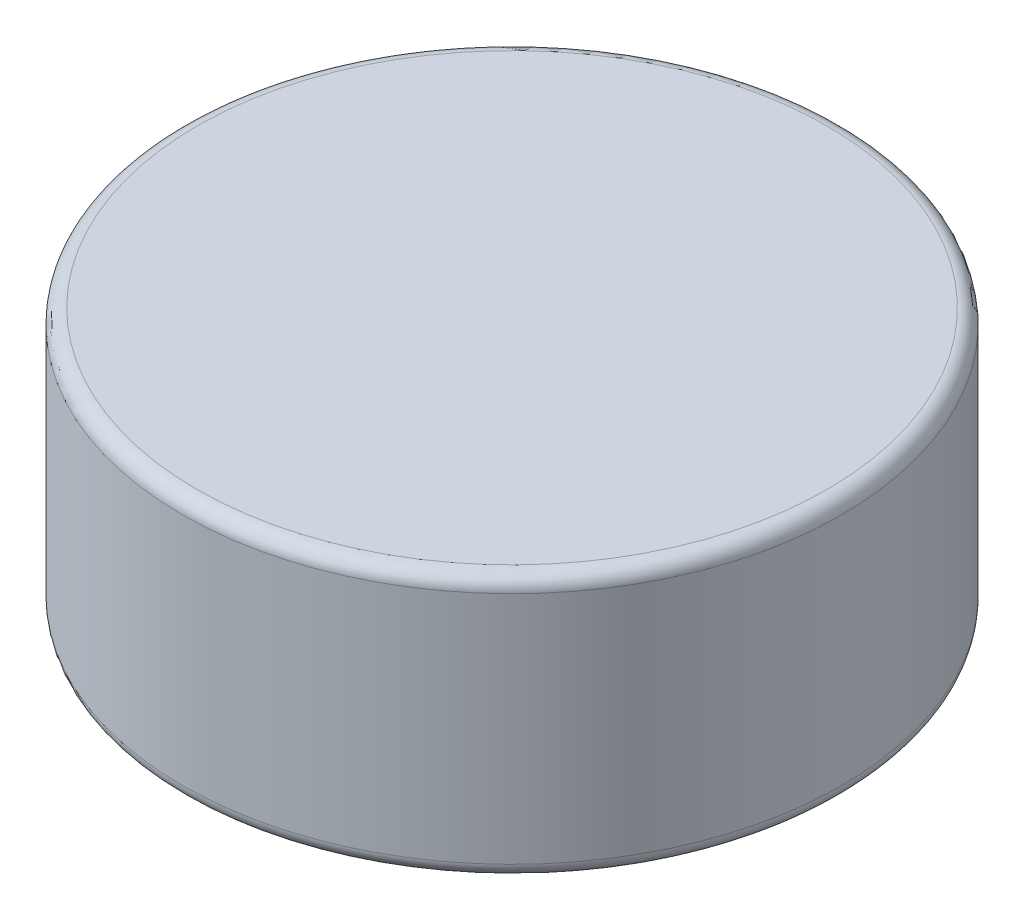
ISO-10303-21;
HEADER;
FILE_DESCRIPTION(('STEP AP214'),'2;1');
FILE_NAME('part.step','',(''),(''),'','','');
FILE_SCHEMA(('AUTOMOTIVE_DESIGN { 1 0 10303 214 1 1 1 1 }'));
ENDSEC;
DATA;
#1=APPLICATION_CONTEXT('core data for automotive mechanical design processes');
#2=APPLICATION_PROTOCOL_DEFINITION('international standard','automotive_design',2000,#1);
#3=PRODUCT_CONTEXT('',#1,'mechanical');
#4=PRODUCT('Part','Part','',(#3));
#5=PRODUCT_RELATED_PRODUCT_CATEGORY('part','',(#4));
#6=PRODUCT_DEFINITION_FORMATION('','',#4);
#7=PRODUCT_DEFINITION_CONTEXT('part definition',#1,'design');
#8=PRODUCT_DEFINITION('design','',#6,#7);
#9=PRODUCT_DEFINITION_SHAPE('','',#8);
#10=(LENGTH_UNIT() NAMED_UNIT(*) SI_UNIT(.MILLI.,.METRE.));
#11=(NAMED_UNIT(*) PLANE_ANGLE_UNIT() SI_UNIT($,.RADIAN.));
#12=(NAMED_UNIT(*) SI_UNIT($,.STERADIAN.) SOLID_ANGLE_UNIT());
#13=UNCERTAINTY_MEASURE_WITH_UNIT(LENGTH_MEASURE(1.E-05),#10,'distance_accuracy_value','');
#14=(GEOMETRIC_REPRESENTATION_CONTEXT(3) GLOBAL_UNCERTAINTY_ASSIGNED_CONTEXT((#13)) GLOBAL_UNIT_ASSIGNED_CONTEXT((#10,
#11,#12)) REPRESENTATION_CONTEXT('',''));
#15=CARTESIAN_POINT('',(0.,0.,0.));
#16=DIRECTION('',(0.,0.,1.));
#17=DIRECTION('',(1.,0.,0.));
#18=AXIS2_PLACEMENT_3D('',#15,#16,#17);
#19=CARTESIAN_POINT('',(0.,18.,0.));
#20=DIRECTION('',(0.,-1.,0.));
#21=DIRECTION('',(0.,0.,-1.));
#22=AXIS2_PLACEMENT_3D('',#19,#20,#21);
#23=CYLINDRICAL_SURFACE('',#22,22.5);
#24=CARTESIAN_POINT('',(0.,1.,0.));
#25=DIRECTION('',(0.,1.,0.));
#26=DIRECTION('',(0.,0.,1.));
#27=AXIS2_PLACEMENT_3D('',#24,#25,#26);
#28=CIRCLE('',#27,22.5);
#29=CARTESIAN_POINT('',(0.,1.,22.5));
#30=VERTEX_POINT('',#29);
#31=EDGE_CURVE('E43',#30,#30,#28,.T.);
#32=ORIENTED_EDGE('',*,*,#31,.T.);
#33=EDGE_LOOP('',(#32));
#34=FACE_BOUND('',#33,.T.);
#35=CARTESIAN_POINT('',(0.,17.,0.));
#36=DIRECTION('',(0.,1.,0.));
#37=DIRECTION('',(0.,0.,1.));
#38=AXIS2_PLACEMENT_3D('',#35,#36,#37);
#39=CIRCLE('',#38,22.5);
#40=CARTESIAN_POINT('',(0.,17.,22.5));
#41=VERTEX_POINT('',#40);
#42=EDGE_CURVE('E47',#41,#41,#39,.F.);
#43=ORIENTED_EDGE('',*,*,#42,.T.);
#44=EDGE_LOOP('',(#43));
#45=FACE_BOUND('',#44,.T.);
#46=ADVANCED_FACE('F32',(#34,#45),#23,.T.);
#47=CARTESIAN_POINT('',(0.,18.,0.));
#48=DIRECTION('',(0.,1.,0.));
#49=DIRECTION('',(0.,0.,1.));
#50=AXIS2_PLACEMENT_3D('',#47,#48,#49);
#51=PLANE('',#50);
#52=CARTESIAN_POINT('',(0.,18.,0.));
#53=DIRECTION('',(0.,1.,0.));
#54=DIRECTION('',(0.,0.,1.));
#55=AXIS2_PLACEMENT_3D('',#52,#53,#54);
#56=CIRCLE('',#55,21.5);
#57=CARTESIAN_POINT('',(0.,18.,21.5));
#58=VERTEX_POINT('',#57);
#59=EDGE_CURVE('E10',#58,#58,#56,.T.);
#60=ORIENTED_EDGE('',*,*,#59,.T.);
#61=EDGE_LOOP('',(#60));
#62=FACE_BOUND('',#61,.T.);
#63=ADVANCED_FACE('F63',(#62),#51,.T.);
#64=CARTESIAN_POINT('',(0.,0.,0.));
#65=DIRECTION('',(0.,1.,0.));
#66=DIRECTION('',(0.,0.,1.));
#67=AXIS2_PLACEMENT_3D('',#64,#65,#66);
#68=PLANE('',#67);
#69=CARTESIAN_POINT('',(0.,0.,0.));
#70=DIRECTION('',(0.,1.,0.));
#71=DIRECTION('',(0.,0.,1.));
#72=AXIS2_PLACEMENT_3D('',#69,#70,#71);
#73=CIRCLE('',#72,21.5);
#74=CARTESIAN_POINT('',(0.,0.,21.5));
#75=VERTEX_POINT('',#74);
#76=EDGE_CURVE('E39',#75,#75,#73,.F.);
#77=ORIENTED_EDGE('',*,*,#76,.T.);
#78=EDGE_LOOP('',(#77));
#79=FACE_BOUND('',#78,.T.);
#80=ADVANCED_FACE('F60',(#79),#68,.F.);
#81=CARTESIAN_POINT('',(0.,1.,0.));
#82=DIRECTION('',(0.,1.,0.));
#83=DIRECTION('',(0.,0.,1.));
#84=AXIS2_PLACEMENT_3D('',#81,#82,#83);
#85=TOROIDAL_SURFACE('',#84,21.5,1.);
#86=ORIENTED_EDGE('',*,*,#76,.F.);
#87=EDGE_LOOP('',(#86));
#88=FACE_BOUND('',#87,.T.);
#89=ORIENTED_EDGE('',*,*,#31,.F.);
#90=EDGE_LOOP('',(#89));
#91=FACE_BOUND('',#90,.T.);
#92=ADVANCED_FACE('F56',(#88,#91),#85,.T.);
#93=CARTESIAN_POINT('',(0.,17.,0.));
#94=DIRECTION('',(0.,1.,0.));
#95=DIRECTION('',(0.,0.,1.));
#96=AXIS2_PLACEMENT_3D('',#93,#94,#95);
#97=TOROIDAL_SURFACE('',#96,21.5,1.);
#98=ORIENTED_EDGE('',*,*,#42,.F.);
#99=EDGE_LOOP('',(#98));
#100=FACE_BOUND('',#99,.T.);
#101=ORIENTED_EDGE('',*,*,#59,.F.);
#102=EDGE_LOOP('',(#101));
#103=FACE_BOUND('',#102,.T.);
#104=ADVANCED_FACE('F34',(#100,#103),#97,.T.);
#105=CLOSED_SHELL('',(#46,#63,#80,#92,#104));
#106=MANIFOLD_SOLID_BREP('B2',#105);
#107=ADVANCED_BREP_SHAPE_REPRESENTATION('',(#18,#106),#14);
#108=SHAPE_DEFINITION_REPRESENTATION(#9,#107);
ENDSEC;
END-ISO-10303-21;
